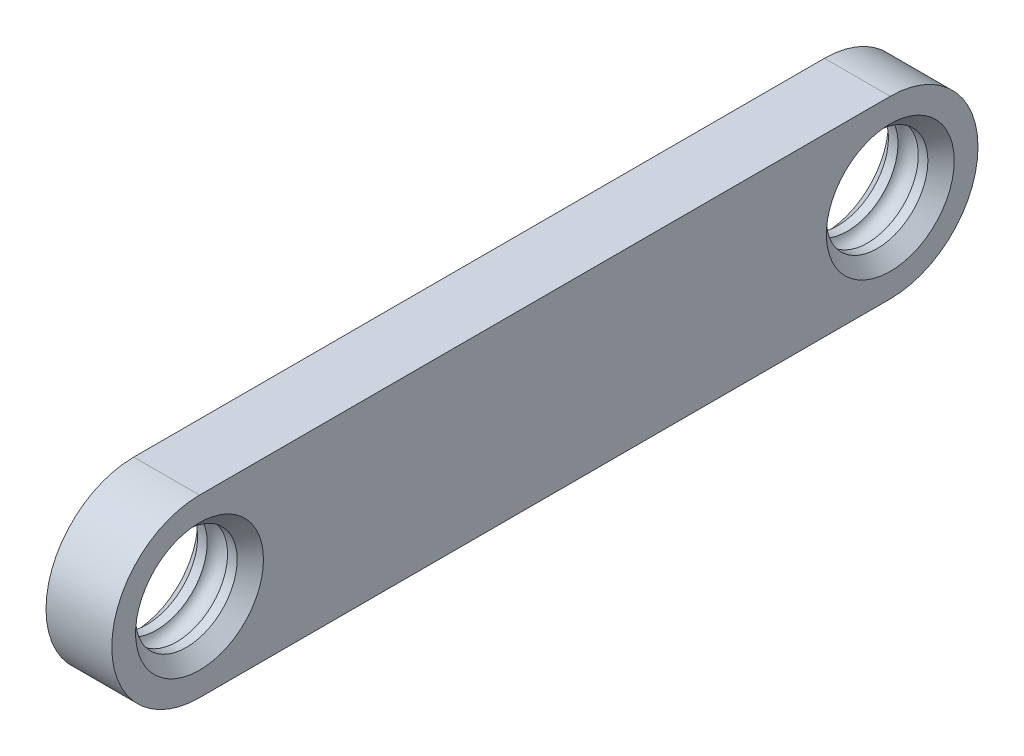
ISO-10303-21;
HEADER;
FILE_DESCRIPTION(('STEP AP214'),'2;1');
FILE_NAME('part.step','',(''),(''),'','','');
FILE_SCHEMA(('AUTOMOTIVE_DESIGN { 1 0 10303 214 1 1 1 1 }'));
ENDSEC;
DATA;
#1=APPLICATION_CONTEXT('core data for automotive mechanical design processes');
#2=APPLICATION_PROTOCOL_DEFINITION('international standard','automotive_design',2000,#1);
#3=PRODUCT_CONTEXT('',#1,'mechanical');
#4=PRODUCT('Part','Part','',(#3));
#5=PRODUCT_RELATED_PRODUCT_CATEGORY('part','',(#4));
#6=PRODUCT_DEFINITION_FORMATION('','',#4);
#7=PRODUCT_DEFINITION_CONTEXT('part definition',#1,'design');
#8=PRODUCT_DEFINITION('design','',#6,#7);
#9=PRODUCT_DEFINITION_SHAPE('','',#8);
#10=(LENGTH_UNIT() NAMED_UNIT(*) SI_UNIT(.MILLI.,.METRE.));
#11=(NAMED_UNIT(*) PLANE_ANGLE_UNIT() SI_UNIT($,.RADIAN.));
#12=(NAMED_UNIT(*) SI_UNIT($,.STERADIAN.) SOLID_ANGLE_UNIT());
#13=UNCERTAINTY_MEASURE_WITH_UNIT(LENGTH_MEASURE(1.E-05),#10,'distance_accuracy_value','');
#14=(GEOMETRIC_REPRESENTATION_CONTEXT(3) GLOBAL_UNCERTAINTY_ASSIGNED_CONTEXT((#13)) GLOBAL_UNIT_ASSIGNED_CONTEXT((#10,
#11,#12)) REPRESENTATION_CONTEXT('',''));
#15=CARTESIAN_POINT('',(0.,0.,0.));
#16=DIRECTION('',(0.,0.,1.));
#17=DIRECTION('',(1.,0.,0.));
#18=AXIS2_PLACEMENT_3D('',#15,#16,#17);
#19=CARTESIAN_POINT('',(4.7625,0.,-50.));
#20=DIRECTION('',(-1.,0.,0.));
#21=DIRECTION('',(0.,0.,1.));
#22=AXIS2_PLACEMENT_3D('',#19,#20,#21);
#23=CYLINDRICAL_SURFACE('',#22,3.675);
#24=CARTESIAN_POINT('',(1.64637649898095,0.,-50.));
#25=DIRECTION('',(1.,0.,0.));
#26=DIRECTION('',(0.,0.,-1.));
#27=AXIS2_PLACEMENT_3D('',#24,#25,#26);
#28=CIRCLE('',#27,3.675);
#29=CARTESIAN_POINT('',(1.64637649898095,0.,-46.325));
#30=VERTEX_POINT('',#29);
#31=EDGE_CURVE('E47',#30,#30,#28,.F.);
#32=CARTESIAN_POINT('',(0.95249999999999,0.,-50.));
#33=DIRECTION('',(1.,0.,0.));
#34=DIRECTION('',(0.,0.,-1.));
#35=AXIS2_PLACEMENT_3D('',#32,#33,#34);
#36=CIRCLE('',#35,3.675);
#37=CARTESIAN_POINT('',(0.952499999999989,0.,-46.325));
#38=VERTEX_POINT('',#37);
#39=EDGE_CURVE('E11',#38,#38,#36,.F.);
#40=CARTESIAN_POINT('',(1.64637649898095,0.,-46.325));
#41=CARTESIAN_POINT('',(1.63914861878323,0.,-46.325));
#42=CARTESIAN_POINT('',(1.63192073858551,0.,-46.325));
#43=CARTESIAN_POINT('',(1.61746497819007,0.,-46.325));
#44=CARTESIAN_POINT('',(1.61023709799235,0.,-46.325));
#45=CARTESIAN_POINT('',(1.59578133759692,0.,-46.325));
#46=CARTESIAN_POINT('',(1.5885534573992,0.,-46.325));
#47=CARTESIAN_POINT('',(1.57409769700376,0.,-46.325));
#48=CARTESIAN_POINT('',(1.56686981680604,0.,-46.325));
#49=CARTESIAN_POINT('',(1.55241405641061,0.,-46.325));
#50=CARTESIAN_POINT('',(1.54518617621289,0.,-46.325));
#51=CARTESIAN_POINT('',(1.53073041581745,0.,-46.325));
#52=CARTESIAN_POINT('',(1.52350253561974,0.,-46.325));
#53=CARTESIAN_POINT('',(1.5090467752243,0.,-46.325));
#54=CARTESIAN_POINT('',(1.50181889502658,0.,-46.325));
#55=CARTESIAN_POINT('',(1.48736313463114,0.,-46.325));
#56=CARTESIAN_POINT('',(1.48013525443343,0.,-46.325));
#57=CARTESIAN_POINT('',(1.46567949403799,0.,-46.325));
#58=CARTESIAN_POINT('',(1.45845161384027,0.,-46.325));
#59=CARTESIAN_POINT('',(1.44399585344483,0.,-46.325));
#60=CARTESIAN_POINT('',(1.43676797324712,0.,-46.325));
#61=CARTESIAN_POINT('',(1.42231221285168,0.,-46.325));
#62=CARTESIAN_POINT('',(1.41508433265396,0.,-46.325));
#63=CARTESIAN_POINT('',(1.40062857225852,0.,-46.325));
#64=CARTESIAN_POINT('',(1.39340069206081,0.,-46.325));
#65=CARTESIAN_POINT('',(1.37894493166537,0.,-46.325));
#66=CARTESIAN_POINT('',(1.37171705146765,0.,-46.325));
#67=CARTESIAN_POINT('',(1.35726129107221,0.,-46.325));
#68=CARTESIAN_POINT('',(1.3500334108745,0.,-46.325));
#69=CARTESIAN_POINT('',(1.33557765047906,0.,-46.325));
#70=CARTESIAN_POINT('',(1.32834977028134,0.,-46.325));
#71=CARTESIAN_POINT('',(1.3138940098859,0.,-46.325));
#72=CARTESIAN_POINT('',(1.30666612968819,0.,-46.325));
#73=CARTESIAN_POINT('',(1.29221036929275,0.,-46.325));
#74=CARTESIAN_POINT('',(1.28498248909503,0.,-46.325));
#75=CARTESIAN_POINT('',(1.27052672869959,0.,-46.325));
#76=CARTESIAN_POINT('',(1.26329884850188,0.,-46.325));
#77=CARTESIAN_POINT('',(1.24884308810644,0.,-46.325));
#78=CARTESIAN_POINT('',(1.24161520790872,0.,-46.325));
#79=CARTESIAN_POINT('',(1.22715944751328,0.,-46.325));
#80=CARTESIAN_POINT('',(1.21993156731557,0.,-46.325));
#81=CARTESIAN_POINT('',(1.20547580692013,0.,-46.325));
#82=CARTESIAN_POINT('',(1.19824792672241,0.,-46.325));
#83=CARTESIAN_POINT('',(1.18379216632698,0.,-46.325));
#84=CARTESIAN_POINT('',(1.17656428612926,0.,-46.325));
#85=CARTESIAN_POINT('',(1.16210852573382,0.,-46.325));
#86=CARTESIAN_POINT('',(1.1548806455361,0.,-46.325));
#87=CARTESIAN_POINT('',(1.14042488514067,0.,-46.325));
#88=CARTESIAN_POINT('',(1.13319700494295,0.,-46.325));
#89=CARTESIAN_POINT('',(1.11874124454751,0.,-46.325));
#90=CARTESIAN_POINT('',(1.11151336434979,0.,-46.325));
#91=CARTESIAN_POINT('',(1.09705760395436,0.,-46.325));
#92=CARTESIAN_POINT('',(1.08982972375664,0.,-46.325));
#93=CARTESIAN_POINT('',(1.0753739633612,0.,-46.325));
#94=CARTESIAN_POINT('',(1.06814608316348,0.,-46.325));
#95=CARTESIAN_POINT('',(1.05369032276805,0.,-46.325));
#96=CARTESIAN_POINT('',(1.04646244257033,0.,-46.325));
#97=CARTESIAN_POINT('',(1.03200668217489,0.,-46.325));
#98=CARTESIAN_POINT('',(1.02477880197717,0.,-46.325));
#99=CARTESIAN_POINT('',(1.01032304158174,0.,-46.325));
#100=CARTESIAN_POINT('',(1.00309516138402,0.,-46.325));
#101=CARTESIAN_POINT('',(0.988639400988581,0.,-46.325));
#102=CARTESIAN_POINT('',(0.981411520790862,0.,-46.325));
#103=CARTESIAN_POINT('',(0.966955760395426,0.,-46.325));
#104=CARTESIAN_POINT('',(0.959727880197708,0.,-46.325));
#105=CARTESIAN_POINT('',(0.952499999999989,0.,-46.325));
#106=B_SPLINE_CURVE_WITH_KNOTS('',3,(#40,#41,#42,#43,#44,#45,#46,#47,#48,#49,#50,#51,#52,#53,
#54,#55,#56,#57,#58,#59,#60,#61,#62,#63,#64,#65,#66,#67,#68,#69,#70,#71,#72,#73,#74,#75,#76,#77,
#78,#79,#80,#81,#82,#83,#84,#85,#86,#87,#88,#89,#90,#91,#92,#93,#94,#95,#96,#97,#98,#99,#100,
#101,#102,#103,#104,#105),.UNSPECIFIED.,.F.,.F.,(4,2,2,2,2,2,2,2,2,2,2,2,2,2,2,2,2,2,2,2,2,2,2,
2,2,2,2,2,2,2,2,2,4),(0.,0.0216836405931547,0.0433672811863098,0.0650509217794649,
0.0867345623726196,0.108418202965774,0.130101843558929,0.151785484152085,0.173469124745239,
0.195152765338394,0.216836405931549,0.238520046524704,0.260203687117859,0.281887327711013,
0.303570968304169,0.325254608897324,0.346938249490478,0.368621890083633,0.390305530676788,
0.411989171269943,0.433672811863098,0.455356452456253,0.477040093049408,0.498723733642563,
0.520407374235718,0.542091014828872,0.563774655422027,0.585458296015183,0.607141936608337,
0.628825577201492,0.650509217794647,0.672192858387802,0.693876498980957),.UNSPECIFIED.);
#107=EDGE_CURVE('BSEAM42',#30,#38,#106,.T.);
#108=ORIENTED_EDGE('',*,*,#31,.F.);
#109=ORIENTED_EDGE('',*,*,#39,.T.);
#110=ORIENTED_EDGE('',*,*,#107,.T.);
#111=ORIENTED_EDGE('',*,*,#107,.F.);
#112=EDGE_LOOP('',(#108,#110,#109,#111));
#113=FACE_BOUND('',#112,.T.);
#114=ADVANCED_FACE('F42',(#113),#23,.F.);
#115=CARTESIAN_POINT('',(4.7625,0.,0.));
#116=DIRECTION('',(-1.,0.,0.));
#117=DIRECTION('',(0.,0.,1.));
#118=AXIS2_PLACEMENT_3D('',#115,#116,#117);
#119=CYLINDRICAL_SURFACE('',#118,3.675);
#120=CARTESIAN_POINT('',(1.64637649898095,0.,0.));
#121=DIRECTION('',(1.,0.,0.));
#122=DIRECTION('',(0.,0.,-1.));
#123=AXIS2_PLACEMENT_3D('',#120,#121,#122);
#124=CIRCLE('',#123,3.675);
#125=CARTESIAN_POINT('',(1.64637649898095,0.,3.675));
#126=VERTEX_POINT('',#125);
#127=EDGE_CURVE('E115',#126,#126,#124,.F.);
#128=CARTESIAN_POINT('',(0.952499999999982,0.,0.));
#129=DIRECTION('',(1.,0.,0.));
#130=DIRECTION('',(0.,0.,-1.));
#131=AXIS2_PLACEMENT_3D('',#128,#129,#130);
#132=CIRCLE('',#131,3.675);
#133=CARTESIAN_POINT('',(0.952499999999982,0.,3.675));
#134=VERTEX_POINT('',#133);
#135=EDGE_CURVE('E132',#134,#134,#132,.F.);
#136=CARTESIAN_POINT('',(1.64637649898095,0.,3.675));
#137=CARTESIAN_POINT('',(1.63914861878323,0.,3.675));
#138=CARTESIAN_POINT('',(1.63192073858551,0.,3.675));
#139=CARTESIAN_POINT('',(1.61746497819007,0.,3.675));
#140=CARTESIAN_POINT('',(1.61023709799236,0.,3.675));
#141=CARTESIAN_POINT('',(1.59578133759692,0.,3.675));
#142=CARTESIAN_POINT('',(1.5885534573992,0.,3.675));
#143=CARTESIAN_POINT('',(1.57409769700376,0.,3.675));
#144=CARTESIAN_POINT('',(1.56686981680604,0.,3.675));
#145=CARTESIAN_POINT('',(1.55241405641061,0.,3.675));
#146=CARTESIAN_POINT('',(1.54518617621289,0.,3.675));
#147=CARTESIAN_POINT('',(1.53073041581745,0.,3.675));
#148=CARTESIAN_POINT('',(1.52350253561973,0.,3.675));
#149=CARTESIAN_POINT('',(1.5090467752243,0.,3.675));
#150=CARTESIAN_POINT('',(1.50181889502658,0.,3.675));
#151=CARTESIAN_POINT('',(1.48736313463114,0.,3.675));
#152=CARTESIAN_POINT('',(1.48013525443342,0.,3.675));
#153=CARTESIAN_POINT('',(1.46567949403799,0.,3.675));
#154=CARTESIAN_POINT('',(1.45845161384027,0.,3.675));
#155=CARTESIAN_POINT('',(1.44399585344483,0.,3.675));
#156=CARTESIAN_POINT('',(1.43676797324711,0.,3.675));
#157=CARTESIAN_POINT('',(1.42231221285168,0.,3.675));
#158=CARTESIAN_POINT('',(1.41508433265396,0.,3.675));
#159=CARTESIAN_POINT('',(1.40062857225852,0.,3.675));
#160=CARTESIAN_POINT('',(1.3934006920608,0.,3.675));
#161=CARTESIAN_POINT('',(1.37894493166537,0.,3.675));
#162=CARTESIAN_POINT('',(1.37171705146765,0.,3.675));
#163=CARTESIAN_POINT('',(1.35726129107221,0.,3.675));
#164=CARTESIAN_POINT('',(1.35003341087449,0.,3.675));
#165=CARTESIAN_POINT('',(1.33557765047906,0.,3.675));
#166=CARTESIAN_POINT('',(1.32834977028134,0.,3.675));
#167=CARTESIAN_POINT('',(1.3138940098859,0.,3.675));
#168=CARTESIAN_POINT('',(1.30666612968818,0.,3.675));
#169=CARTESIAN_POINT('',(1.29221036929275,0.,3.675));
#170=CARTESIAN_POINT('',(1.28498248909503,0.,3.675));
#171=CARTESIAN_POINT('',(1.27052672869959,0.,3.675));
#172=CARTESIAN_POINT('',(1.26329884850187,0.,3.675));
#173=CARTESIAN_POINT('',(1.24884308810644,0.,3.675));
#174=CARTESIAN_POINT('',(1.24161520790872,0.,3.675));
#175=CARTESIAN_POINT('',(1.22715944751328,0.,3.675));
#176=CARTESIAN_POINT('',(1.21993156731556,0.,3.675));
#177=CARTESIAN_POINT('',(1.20547580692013,0.,3.675));
#178=CARTESIAN_POINT('',(1.19824792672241,0.,3.675));
#179=CARTESIAN_POINT('',(1.18379216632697,0.,3.675));
#180=CARTESIAN_POINT('',(1.17656428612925,0.,3.675));
#181=CARTESIAN_POINT('',(1.16210852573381,0.,3.675));
#182=CARTESIAN_POINT('',(1.1548806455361,0.,3.675));
#183=CARTESIAN_POINT('',(1.14042488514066,0.,3.675));
#184=CARTESIAN_POINT('',(1.13319700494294,0.,3.675));
#185=CARTESIAN_POINT('',(1.1187412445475,0.,3.675));
#186=CARTESIAN_POINT('',(1.11151336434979,0.,3.675));
#187=CARTESIAN_POINT('',(1.09705760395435,0.,3.675));
#188=CARTESIAN_POINT('',(1.08982972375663,0.,3.675));
#189=CARTESIAN_POINT('',(1.07537396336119,0.,3.675));
#190=CARTESIAN_POINT('',(1.06814608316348,0.,3.675));
#191=CARTESIAN_POINT('',(1.05369032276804,0.,3.675));
#192=CARTESIAN_POINT('',(1.04646244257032,0.,3.675));
#193=CARTESIAN_POINT('',(1.03200668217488,0.,3.675));
#194=CARTESIAN_POINT('',(1.02477880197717,0.,3.675));
#195=CARTESIAN_POINT('',(1.01032304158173,0.,3.675));
#196=CARTESIAN_POINT('',(1.00309516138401,0.,3.675));
#197=CARTESIAN_POINT('',(0.988639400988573,0.,3.675));
#198=CARTESIAN_POINT('',(0.981411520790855,0.,3.675));
#199=CARTESIAN_POINT('',(0.966955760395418,0.,3.675));
#200=CARTESIAN_POINT('',(0.9597278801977,0.,3.675));
#201=CARTESIAN_POINT('',(0.952499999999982,0.,3.675));
#202=B_SPLINE_CURVE_WITH_KNOTS('',3,(#136,#137,#138,#139,#140,#141,#142,#143,#144,#145,#146,
#147,#148,#149,#150,#151,#152,#153,#154,#155,#156,#157,#158,#159,#160,#161,#162,#163,#164,#165,
#166,#167,#168,#169,#170,#171,#172,#173,#174,#175,#176,#177,#178,#179,#180,#181,#182,#183,#184,
#185,#186,#187,#188,#189,#190,#191,#192,#193,#194,#195,#196,#197,#198,#199,#200,#201),
.UNSPECIFIED.,.F.,.F.,(4,2,2,2,2,2,2,2,2,2,2,2,2,2,2,2,2,2,2,2,2,2,2,2,2,2,2,2,2,2,2,2,4),(0.,
0.0216836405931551,0.0433672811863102,0.0650509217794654,0.0867345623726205,0.108418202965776,
0.130101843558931,0.151785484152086,0.173469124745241,0.195152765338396,0.216836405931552,
0.238520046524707,0.260203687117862,0.281887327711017,0.303570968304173,0.325254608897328,
0.346938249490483,0.368621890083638,0.390305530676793,0.411989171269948,0.433672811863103,
0.455356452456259,0.477040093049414,0.498723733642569,0.520407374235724,0.542091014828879,
0.563774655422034,0.585458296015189,0.607141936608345,0.6288255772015,0.650509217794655,
0.67219285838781,0.693876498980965),.UNSPECIFIED.);
#203=EDGE_CURVE('BSEAM158',#126,#134,#202,.T.);
#204=ORIENTED_EDGE('',*,*,#127,.F.);
#205=ORIENTED_EDGE('',*,*,#135,.T.);
#206=ORIENTED_EDGE('',*,*,#203,.T.);
#207=ORIENTED_EDGE('',*,*,#203,.F.);
#208=EDGE_LOOP('',(#204,#206,#205,#207));
#209=FACE_BOUND('',#208,.T.);
#210=ADVANCED_FACE('F158',(#209),#119,.F.);
#211=CARTESIAN_POINT('',(4.7625,-6.35,0.));
#212=DIRECTION('',(0.,1.,0.));
#213=DIRECTION('',(0.,0.,1.));
#214=AXIS2_PLACEMENT_3D('',#211,#212,#213);
#215=PLANE('',#214);
#216=DIRECTION('',(0.,0.,-1.));
#217=VECTOR('',#216,1.);
#218=CARTESIAN_POINT('',(0.,-6.35,0.));
#219=LINE('',#218,#217);
#220=CARTESIAN_POINT('',(0.,-6.35,0.));
#221=VERTEX_POINT('',#220);
#222=CARTESIAN_POINT('',(0.,-6.35,-50.));
#223=VERTEX_POINT('',#222);
#224=EDGE_CURVE('E112',#221,#223,#219,.T.);
#225=ORIENTED_EDGE('',*,*,#224,.T.);
#226=DIRECTION('',(-1.,0.,0.));
#227=VECTOR('',#226,1.);
#228=CARTESIAN_POINT('',(4.7625,-6.35,-50.));
#229=LINE('',#228,#227);
#230=CARTESIAN_POINT('',(4.7625,-6.35,-50.));
#231=VERTEX_POINT('',#230);
#232=EDGE_CURVE('E104',#231,#223,#229,.T.);
#233=ORIENTED_EDGE('',*,*,#232,.F.);
#234=DIRECTION('',(0.,0.,-1.));
#235=VECTOR('',#234,1.);
#236=CARTESIAN_POINT('',(4.7625,-6.35,0.));
#237=LINE('',#236,#235);
#238=CARTESIAN_POINT('',(4.7625,-6.35,0.));
#239=VERTEX_POINT('',#238);
#240=EDGE_CURVE('E94',#239,#231,#237,.T.);
#241=ORIENTED_EDGE('',*,*,#240,.F.);
#242=DIRECTION('',(-1.,0.,0.));
#243=VECTOR('',#242,1.);
#244=CARTESIAN_POINT('',(4.7625,-6.35,0.));
#245=LINE('',#244,#243);
#246=EDGE_CURVE('E108',#239,#221,#245,.T.);
#247=ORIENTED_EDGE('',*,*,#246,.T.);
#248=EDGE_LOOP('',(#225,#233,#241,#247));
#249=FACE_BOUND('',#248,.T.);
#250=ADVANCED_FACE('F177',(#249),#215,.F.);
#251=CARTESIAN_POINT('',(4.7625,0.,-50.));
#252=DIRECTION('',(-1.,0.,0.));
#253=DIRECTION('',(0.,0.,1.));
#254=AXIS2_PLACEMENT_3D('',#251,#252,#253);
#255=CYLINDRICAL_SURFACE('',#254,6.35);
#256=CARTESIAN_POINT('',(0.,0.,-50.));
#257=DIRECTION('',(1.,0.,0.));
#258=DIRECTION('',(0.,0.,-1.));
#259=AXIS2_PLACEMENT_3D('',#256,#257,#258);
#260=CIRCLE('',#259,6.35);
#261=CARTESIAN_POINT('',(0.,6.35,-50.));
#262=VERTEX_POINT('',#261);
#263=EDGE_CURVE('E100',#223,#262,#260,.T.);
#264=ORIENTED_EDGE('',*,*,#263,.T.);
#265=DIRECTION('',(-1.,0.,0.));
#266=VECTOR('',#265,1.);
#267=CARTESIAN_POINT('',(4.7625,6.35,-50.));
#268=LINE('',#267,#266);
#269=CARTESIAN_POINT('',(4.7625,6.35,-50.));
#270=VERTEX_POINT('',#269);
#271=EDGE_CURVE('E98',#270,#262,#268,.T.);
#272=ORIENTED_EDGE('',*,*,#271,.F.);
#273=CARTESIAN_POINT('',(4.7625,0.,-50.));
#274=DIRECTION('',(1.,0.,0.));
#275=DIRECTION('',(0.,0.,-1.));
#276=AXIS2_PLACEMENT_3D('',#273,#274,#275);
#277=CIRCLE('',#276,6.35);
#278=EDGE_CURVE('E89',#231,#270,#277,.T.);
#279=ORIENTED_EDGE('',*,*,#278,.F.);
#280=ORIENTED_EDGE('',*,*,#232,.T.);
#281=EDGE_LOOP('',(#264,#272,#279,#280));
#282=FACE_BOUND('',#281,.T.);
#283=ADVANCED_FACE('F99',(#282),#255,.T.);
#284=CARTESIAN_POINT('',(4.7625,6.35,0.));
#285=DIRECTION('',(0.,1.,0.));
#286=DIRECTION('',(0.,0.,1.));
#287=AXIS2_PLACEMENT_3D('',#284,#285,#286);
#288=PLANE('',#287);
#289=DIRECTION('',(0.,0.,-1.));
#290=VECTOR('',#289,1.);
#291=CARTESIAN_POINT('',(0.,6.35,0.));
#292=LINE('',#291,#290);
#293=CARTESIAN_POINT('',(0.,6.35,0.));
#294=VERTEX_POINT('',#293);
#295=EDGE_CURVE('E117',#294,#262,#292,.T.);
#296=ORIENTED_EDGE('',*,*,#295,.F.);
#297=DIRECTION('',(-1.,0.,0.));
#298=VECTOR('',#297,1.);
#299=CARTESIAN_POINT('',(4.7625,6.35,0.));
#300=LINE('',#299,#298);
#301=CARTESIAN_POINT('',(4.7625,6.35,0.));
#302=VERTEX_POINT('',#301);
#303=EDGE_CURVE('E78',#302,#294,#300,.T.);
#304=ORIENTED_EDGE('',*,*,#303,.F.);
#305=DIRECTION('',(0.,0.,-1.));
#306=VECTOR('',#305,1.);
#307=CARTESIAN_POINT('',(4.7625,6.35,0.));
#308=LINE('',#307,#306);
#309=EDGE_CURVE('E92',#302,#270,#308,.T.);
#310=ORIENTED_EDGE('',*,*,#309,.T.);
#311=ORIENTED_EDGE('',*,*,#271,.T.);
#312=EDGE_LOOP('',(#296,#304,#310,#311));
#313=FACE_BOUND('',#312,.T.);
#314=ADVANCED_FACE('F106',(#313),#288,.T.);
#315=CARTESIAN_POINT('',(3.11612350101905,0.,0.));
#316=DIRECTION('',(-1.,0.,0.));
#317=DIRECTION('',(0.,0.,1.));
#318=AXIS2_PLACEMENT_3D('',#315,#316,#317);
#319=CIRCLE('',#318,3.675);
#320=CARTESIAN_POINT('',(3.11612350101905,0.,3.675));
#321=VERTEX_POINT('',#320);
#322=EDGE_CURVE('E143',#321,#321,#319,.F.);
#323=CARTESIAN_POINT('',(3.80999999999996,0.,0.));
#324=DIRECTION('',(1.,0.,0.));
#325=DIRECTION('',(0.,0.,-1.));
#326=AXIS2_PLACEMENT_3D('',#323,#324,#325);
#327=CIRCLE('',#326,3.675);
#328=CARTESIAN_POINT('',(3.80999999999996,0.,3.675));
#329=VERTEX_POINT('',#328);
#330=EDGE_CURVE('E129',#329,#329,#327,.T.);
#331=CARTESIAN_POINT('',(3.11612350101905,0.,3.675));
#332=CARTESIAN_POINT('',(3.12335138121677,0.,3.675));
#333=CARTESIAN_POINT('',(3.13057926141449,0.,3.675));
#334=CARTESIAN_POINT('',(3.14503502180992,0.,3.675));
#335=CARTESIAN_POINT('',(3.15226290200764,0.,3.675));
#336=CARTESIAN_POINT('',(3.16671866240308,0.,3.675));
#337=CARTESIAN_POINT('',(3.1739465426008,0.,3.675));
#338=CARTESIAN_POINT('',(3.18840230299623,0.,3.675));
#339=CARTESIAN_POINT('',(3.19563018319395,0.,3.675));
#340=CARTESIAN_POINT('',(3.21008594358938,0.,3.675));
#341=CARTESIAN_POINT('',(3.2173138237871,0.,3.675));
#342=CARTESIAN_POINT('',(3.23176958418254,0.,3.675));
#343=CARTESIAN_POINT('',(3.23899746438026,0.,3.675));
#344=CARTESIAN_POINT('',(3.25345322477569,0.,3.675));
#345=CARTESIAN_POINT('',(3.26068110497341,0.,3.675));
#346=CARTESIAN_POINT('',(3.27513686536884,0.,3.675));
#347=CARTESIAN_POINT('',(3.28236474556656,0.,3.675));
#348=CARTESIAN_POINT('',(3.296820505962,0.,3.675));
#349=CARTESIAN_POINT('',(3.30404838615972,0.,3.675));
#350=CARTESIAN_POINT('',(3.31850414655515,0.,3.675));
#351=CARTESIAN_POINT('',(3.32573202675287,0.,3.675));
#352=CARTESIAN_POINT('',(3.3401877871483,0.,3.675));
#353=CARTESIAN_POINT('',(3.34741566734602,0.,3.675));
#354=CARTESIAN_POINT('',(3.36187142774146,0.,3.675));
#355=CARTESIAN_POINT('',(3.36909930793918,0.,3.675));
#356=CARTESIAN_POINT('',(3.38355506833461,0.,3.675));
#357=CARTESIAN_POINT('',(3.39078294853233,0.,3.675));
#358=CARTESIAN_POINT('',(3.40523870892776,0.,3.675));
#359=CARTESIAN_POINT('',(3.41246658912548,0.,3.675));
#360=CARTESIAN_POINT('',(3.42692234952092,0.,3.675));
#361=CARTESIAN_POINT('',(3.43415022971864,0.,3.675));
#362=CARTESIAN_POINT('',(3.44860599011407,0.,3.675));
#363=CARTESIAN_POINT('',(3.45583387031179,0.,3.675));
#364=CARTESIAN_POINT('',(3.47028963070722,0.,3.675));
#365=CARTESIAN_POINT('',(3.47751751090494,0.,3.675));
#366=CARTESIAN_POINT('',(3.49197327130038,0.,3.675));
#367=CARTESIAN_POINT('',(3.4992011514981,0.,3.675));
#368=CARTESIAN_POINT('',(3.51365691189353,0.,3.675));
#369=CARTESIAN_POINT('',(3.52088479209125,0.,3.675));
#370=CARTESIAN_POINT('',(3.53534055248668,0.,3.675));
#371=CARTESIAN_POINT('',(3.5425684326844,0.,3.675));
#372=CARTESIAN_POINT('',(3.55702419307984,0.,3.675));
#373=CARTESIAN_POINT('',(3.56425207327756,0.,3.675));
#374=CARTESIAN_POINT('',(3.57870783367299,0.,3.675));
#375=CARTESIAN_POINT('',(3.58593571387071,0.,3.675));
#376=CARTESIAN_POINT('',(3.60039147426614,0.,3.675));
#377=CARTESIAN_POINT('',(3.60761935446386,0.,3.675));
#378=CARTESIAN_POINT('',(3.6220751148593,0.,3.675));
#379=CARTESIAN_POINT('',(3.62930299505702,0.,3.675));
#380=CARTESIAN_POINT('',(3.64375875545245,0.,3.675));
#381=CARTESIAN_POINT('',(3.65098663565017,0.,3.675));
#382=CARTESIAN_POINT('',(3.6654423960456,0.,3.675));
#383=CARTESIAN_POINT('',(3.67267027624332,0.,3.675));
#384=CARTESIAN_POINT('',(3.68712603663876,0.,3.675));
#385=CARTESIAN_POINT('',(3.69435391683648,0.,3.675));
#386=CARTESIAN_POINT('',(3.70880967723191,0.,3.675));
#387=CARTESIAN_POINT('',(3.71603755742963,0.,3.675));
#388=CARTESIAN_POINT('',(3.73049331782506,0.,3.675));
#389=CARTESIAN_POINT('',(3.73772119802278,0.,3.675));
#390=CARTESIAN_POINT('',(3.75217695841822,0.,3.675));
#391=CARTESIAN_POINT('',(3.75940483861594,0.,3.675));
#392=CARTESIAN_POINT('',(3.77386059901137,0.,3.675));
#393=CARTESIAN_POINT('',(3.78108847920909,0.,3.675));
#394=CARTESIAN_POINT('',(3.79554423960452,0.,3.675));
#395=CARTESIAN_POINT('',(3.80277211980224,0.,3.675));
#396=CARTESIAN_POINT('',(3.80999999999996,0.,3.675));
#397=B_SPLINE_CURVE_WITH_KNOTS('',3,(#331,#332,#333,#334,#335,#336,#337,#338,#339,#340,#341,
#342,#343,#344,#345,#346,#347,#348,#349,#350,#351,#352,#353,#354,#355,#356,#357,#358,#359,#360,
#361,#362,#363,#364,#365,#366,#367,#368,#369,#370,#371,#372,#373,#374,#375,#376,#377,#378,#379,
#380,#381,#382,#383,#384,#385,#386,#387,#388,#389,#390,#391,#392,#393,#394,#395,#396),
.UNSPECIFIED.,.F.,.F.,(4,2,2,2,2,2,2,2,2,2,2,2,2,2,2,2,2,2,2,2,2,2,2,2,2,2,2,2,2,2,2,2,4),(0.,
0.0216836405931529,0.0433672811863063,0.0650509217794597,0.0867345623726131,0.108418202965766,
0.130101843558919,0.151785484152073,0.173469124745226,0.19515276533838,0.216836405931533,
0.238520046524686,0.26020368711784,0.281887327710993,0.303570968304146,0.325254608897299,
0.346938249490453,0.368621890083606,0.39030553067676,0.411989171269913,0.433672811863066,
0.45535645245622,0.477040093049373,0.498723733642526,0.520407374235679,0.542091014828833,
0.563774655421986,0.585458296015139,0.607141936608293,0.628825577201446,0.6505092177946,
0.672192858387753,0.693876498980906),.UNSPECIFIED.);
#398=EDGE_CURVE('BSEAM188',#321,#329,#397,.T.);
#399=ORIENTED_EDGE('',*,*,#322,.F.);
#400=ORIENTED_EDGE('',*,*,#330,.T.);
#401=ORIENTED_EDGE('',*,*,#398,.T.);
#402=ORIENTED_EDGE('',*,*,#398,.F.);
#403=EDGE_LOOP('',(#399,#401,#400,#402));
#404=FACE_BOUND('',#403,.T.);
#405=ADVANCED_FACE('F188',(#404),#119,.F.);
#406=CARTESIAN_POINT('',(3.11612350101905,0.,-50.));
#407=DIRECTION('',(-1.,0.,0.));
#408=DIRECTION('',(0.,0.,1.));
#409=AXIS2_PLACEMENT_3D('',#406,#407,#408);
#410=CIRCLE('',#409,3.675);
#411=CARTESIAN_POINT('',(3.11612350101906,0.,-46.325));
#412=VERTEX_POINT('',#411);
#413=EDGE_CURVE('E147',#412,#412,#410,.F.);
#414=CARTESIAN_POINT('',(3.80999999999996,0.,-50.));
#415=DIRECTION('',(1.,0.,0.));
#416=DIRECTION('',(0.,0.,-1.));
#417=AXIS2_PLACEMENT_3D('',#414,#415,#416);
#418=CIRCLE('',#417,3.675);
#419=CARTESIAN_POINT('',(3.80999999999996,0.,-46.325));
#420=VERTEX_POINT('',#419);
#421=EDGE_CURVE('E53',#420,#420,#418,.T.);
#422=CARTESIAN_POINT('',(3.11612350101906,0.,-46.325));
#423=CARTESIAN_POINT('',(3.12335138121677,0.,-46.325));
#424=CARTESIAN_POINT('',(3.13057926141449,0.,-46.325));
#425=CARTESIAN_POINT('',(3.14503502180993,0.,-46.325));
#426=CARTESIAN_POINT('',(3.15226290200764,0.,-46.325));
#427=CARTESIAN_POINT('',(3.16671866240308,0.,-46.325));
#428=CARTESIAN_POINT('',(3.1739465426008,0.,-46.325));
#429=CARTESIAN_POINT('',(3.18840230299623,0.,-46.325));
#430=CARTESIAN_POINT('',(3.19563018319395,0.,-46.325));
#431=CARTESIAN_POINT('',(3.21008594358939,0.,-46.325));
#432=CARTESIAN_POINT('',(3.2173138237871,0.,-46.325));
#433=CARTESIAN_POINT('',(3.23176958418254,0.,-46.325));
#434=CARTESIAN_POINT('',(3.23899746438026,0.,-46.325));
#435=CARTESIAN_POINT('',(3.25345322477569,0.,-46.325));
#436=CARTESIAN_POINT('',(3.26068110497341,0.,-46.325));
#437=CARTESIAN_POINT('',(3.27513686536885,0.,-46.325));
#438=CARTESIAN_POINT('',(3.28236474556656,0.,-46.325));
#439=CARTESIAN_POINT('',(3.296820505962,0.,-46.325));
#440=CARTESIAN_POINT('',(3.30404838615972,0.,-46.325));
#441=CARTESIAN_POINT('',(3.31850414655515,0.,-46.325));
#442=CARTESIAN_POINT('',(3.32573202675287,0.,-46.325));
#443=CARTESIAN_POINT('',(3.3401877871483,0.,-46.325));
#444=CARTESIAN_POINT('',(3.34741566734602,0.,-46.325));
#445=CARTESIAN_POINT('',(3.36187142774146,0.,-46.325));
#446=CARTESIAN_POINT('',(3.36909930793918,0.,-46.325));
#447=CARTESIAN_POINT('',(3.38355506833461,0.,-46.325));
#448=CARTESIAN_POINT('',(3.39078294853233,0.,-46.325));
#449=CARTESIAN_POINT('',(3.40523870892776,0.,-46.325));
#450=CARTESIAN_POINT('',(3.41246658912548,0.,-46.325));
#451=CARTESIAN_POINT('',(3.42692234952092,0.,-46.325));
#452=CARTESIAN_POINT('',(3.43415022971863,0.,-46.325));
#453=CARTESIAN_POINT('',(3.44860599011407,0.,-46.325));
#454=CARTESIAN_POINT('',(3.45583387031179,0.,-46.325));
#455=CARTESIAN_POINT('',(3.47028963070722,0.,-46.325));
#456=CARTESIAN_POINT('',(3.47751751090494,0.,-46.325));
#457=CARTESIAN_POINT('',(3.49197327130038,0.,-46.325));
#458=CARTESIAN_POINT('',(3.49920115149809,0.,-46.325));
#459=CARTESIAN_POINT('',(3.51365691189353,0.,-46.325));
#460=CARTESIAN_POINT('',(3.52088479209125,0.,-46.325));
#461=CARTESIAN_POINT('',(3.53534055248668,0.,-46.325));
#462=CARTESIAN_POINT('',(3.5425684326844,0.,-46.325));
#463=CARTESIAN_POINT('',(3.55702419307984,0.,-46.325));
#464=CARTESIAN_POINT('',(3.56425207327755,0.,-46.325));
#465=CARTESIAN_POINT('',(3.57870783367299,0.,-46.325));
#466=CARTESIAN_POINT('',(3.58593571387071,0.,-46.325));
#467=CARTESIAN_POINT('',(3.60039147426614,0.,-46.325));
#468=CARTESIAN_POINT('',(3.60761935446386,0.,-46.325));
#469=CARTESIAN_POINT('',(3.6220751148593,0.,-46.325));
#470=CARTESIAN_POINT('',(3.62930299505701,0.,-46.325));
#471=CARTESIAN_POINT('',(3.64375875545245,0.,-46.325));
#472=CARTESIAN_POINT('',(3.65098663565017,0.,-46.325));
#473=CARTESIAN_POINT('',(3.6654423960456,0.,-46.325));
#474=CARTESIAN_POINT('',(3.67267027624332,0.,-46.325));
#475=CARTESIAN_POINT('',(3.68712603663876,0.,-46.325));
#476=CARTESIAN_POINT('',(3.69435391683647,0.,-46.325));
#477=CARTESIAN_POINT('',(3.70880967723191,0.,-46.325));
#478=CARTESIAN_POINT('',(3.71603755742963,0.,-46.325));
#479=CARTESIAN_POINT('',(3.73049331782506,0.,-46.325));
#480=CARTESIAN_POINT('',(3.73772119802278,0.,-46.325));
#481=CARTESIAN_POINT('',(3.75217695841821,0.,-46.325));
#482=CARTESIAN_POINT('',(3.75940483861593,0.,-46.325));
#483=CARTESIAN_POINT('',(3.77386059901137,0.,-46.325));
#484=CARTESIAN_POINT('',(3.78108847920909,0.,-46.325));
#485=CARTESIAN_POINT('',(3.79554423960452,0.,-46.325));
#486=CARTESIAN_POINT('',(3.80277211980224,0.,-46.325));
#487=CARTESIAN_POINT('',(3.80999999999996,0.,-46.325));
#488=B_SPLINE_CURVE_WITH_KNOTS('',3,(#422,#423,#424,#425,#426,#427,#428,#429,#430,#431,#432,
#433,#434,#435,#436,#437,#438,#439,#440,#441,#442,#443,#444,#445,#446,#447,#448,#449,#450,#451,
#452,#453,#454,#455,#456,#457,#458,#459,#460,#461,#462,#463,#464,#465,#466,#467,#468,#469,#470,
#471,#472,#473,#474,#475,#476,#477,#478,#479,#480,#481,#482,#483,#484,#485,#486,#487),
.UNSPECIFIED.,.F.,.F.,(4,2,2,2,2,2,2,2,2,2,2,2,2,2,2,2,2,2,2,2,2,2,2,2,2,2,2,2,2,2,2,2,4),(0.,
0.0216836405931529,0.0433672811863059,0.0650509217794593,0.0867345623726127,0.108418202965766,
0.130101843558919,0.151785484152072,0.173469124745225,0.195152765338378,0.216836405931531,
0.238520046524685,0.260203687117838,0.281887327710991,0.303570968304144,0.325254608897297,
0.346938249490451,0.368621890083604,0.390305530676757,0.41198917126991,0.433672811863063,
0.455356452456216,0.477040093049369,0.498723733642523,0.520407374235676,0.542091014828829,
0.563774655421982,0.585458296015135,0.607141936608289,0.628825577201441,0.650509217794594,
0.672192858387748,0.693876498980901),.UNSPECIFIED.);
#489=EDGE_CURVE('BSEAM160',#412,#420,#488,.T.);
#490=ORIENTED_EDGE('',*,*,#413,.F.);
#491=ORIENTED_EDGE('',*,*,#421,.T.);
#492=ORIENTED_EDGE('',*,*,#489,.T.);
#493=ORIENTED_EDGE('',*,*,#489,.F.);
#494=EDGE_LOOP('',(#490,#492,#491,#493));
#495=FACE_BOUND('',#494,.T.);
#496=ADVANCED_FACE('F160',(#495),#23,.F.);
#497=CARTESIAN_POINT('',(4.7625,0.,0.));
#498=DIRECTION('',(-1.,0.,0.));
#499=DIRECTION('',(0.,0.,1.));
#500=AXIS2_PLACEMENT_3D('',#497,#498,#499);
#501=CYLINDRICAL_SURFACE('',#500,6.35);
#502=CARTESIAN_POINT('',(0.,0.,0.));
#503=DIRECTION('',(1.,0.,0.));
#504=DIRECTION('',(0.,0.,-1.));
#505=AXIS2_PLACEMENT_3D('',#502,#503,#504);
#506=CIRCLE('',#505,6.35);
#507=EDGE_CURVE('E81',#294,#221,#506,.T.);
#508=ORIENTED_EDGE('',*,*,#507,.T.);
#509=ORIENTED_EDGE('',*,*,#246,.F.);
#510=CARTESIAN_POINT('',(4.7625,0.,0.));
#511=DIRECTION('',(1.,0.,0.));
#512=DIRECTION('',(0.,0.,-1.));
#513=AXIS2_PLACEMENT_3D('',#510,#511,#512);
#514=CIRCLE('',#513,6.35);
#515=EDGE_CURVE('E62',#302,#239,#514,.T.);
#516=ORIENTED_EDGE('',*,*,#515,.F.);
#517=ORIENTED_EDGE('',*,*,#303,.T.);
#518=EDGE_LOOP('',(#508,#509,#516,#517));
#519=FACE_BOUND('',#518,.T.);
#520=ADVANCED_FACE('F178',(#519),#501,.T.);
#521=CARTESIAN_POINT('',(4.7625,0.,0.));
#522=DIRECTION('',(1.,0.,0.));
#523=DIRECTION('',(0.,0.,-1.));
#524=AXIS2_PLACEMENT_3D('',#521,#522,#523);
#525=PLANE('',#524);
#526=CARTESIAN_POINT('',(4.7625,0.,0.));
#527=DIRECTION('',(1.,0.,0.));
#528=DIRECTION('',(0.,0.,-1.));
#529=AXIS2_PLACEMENT_3D('',#526,#527,#528);
#530=CIRCLE('',#529,4.62750000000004);
#531=CARTESIAN_POINT('',(4.7625,0.,-4.62750000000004));
#532=VERTEX_POINT('',#531);
#533=EDGE_CURVE('E138',#532,#532,#530,.F.);
#534=ORIENTED_EDGE('',*,*,#533,.T.);
#535=EDGE_LOOP('',(#534));
#536=FACE_BOUND('',#535,.T.);
#537=CARTESIAN_POINT('',(4.7625,0.,-50.));
#538=DIRECTION('',(1.,0.,0.));
#539=DIRECTION('',(0.,0.,-1.));
#540=AXIS2_PLACEMENT_3D('',#537,#538,#539);
#541=CIRCLE('',#540,4.62750000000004);
#542=CARTESIAN_POINT('',(4.7625,0.,-54.6275));
#543=VERTEX_POINT('',#542);
#544=EDGE_CURVE('E135',#543,#543,#541,.F.);
#545=ORIENTED_EDGE('',*,*,#544,.T.);
#546=EDGE_LOOP('',(#545));
#547=FACE_BOUND('',#546,.T.);
#548=ORIENTED_EDGE('',*,*,#240,.T.);
#549=ORIENTED_EDGE('',*,*,#278,.T.);
#550=ORIENTED_EDGE('',*,*,#309,.F.);
#551=ORIENTED_EDGE('',*,*,#515,.T.);
#552=EDGE_LOOP('',(#548,#549,#550,#551));
#553=FACE_BOUND('',#552,.T.);
#554=ADVANCED_FACE('F90',(#536,#547,#553),#525,.T.);
#555=CARTESIAN_POINT('',(0.,0.,0.));
#556=DIRECTION('',(1.,0.,0.));
#557=DIRECTION('',(0.,0.,-1.));
#558=AXIS2_PLACEMENT_3D('',#555,#556,#557);
#559=PLANE('',#558);
#560=CARTESIAN_POINT('',(0.,0.,0.));
#561=DIRECTION('',(1.,0.,0.));
#562=DIRECTION('',(0.,0.,-1.));
#563=AXIS2_PLACEMENT_3D('',#560,#561,#562);
#564=CIRCLE('',#563,4.62749999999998);
#565=CARTESIAN_POINT('',(0.,0.,-4.62749999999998));
#566=VERTEX_POINT('',#565);
#567=EDGE_CURVE('E126',#566,#566,#564,.T.);
#568=ORIENTED_EDGE('',*,*,#567,.T.);
#569=EDGE_LOOP('',(#568));
#570=FACE_BOUND('',#569,.T.);
#571=CARTESIAN_POINT('',(0.,0.,-50.));
#572=DIRECTION('',(1.,0.,0.));
#573=DIRECTION('',(0.,0.,-1.));
#574=AXIS2_PLACEMENT_3D('',#571,#572,#573);
#575=CIRCLE('',#574,4.62749999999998);
#576=CARTESIAN_POINT('',(0.,0.,-54.6275));
#577=VERTEX_POINT('',#576);
#578=EDGE_CURVE('E123',#577,#577,#575,.T.);
#579=ORIENTED_EDGE('',*,*,#578,.T.);
#580=EDGE_LOOP('',(#579));
#581=FACE_BOUND('',#580,.T.);
#582=ORIENTED_EDGE('',*,*,#224,.F.);
#583=ORIENTED_EDGE('',*,*,#507,.F.);
#584=ORIENTED_EDGE('',*,*,#295,.T.);
#585=ORIENTED_EDGE('',*,*,#263,.F.);
#586=EDGE_LOOP('',(#582,#583,#584,#585));
#587=FACE_BOUND('',#586,.T.);
#588=ADVANCED_FACE('F169',(#570,#581,#587),#559,.F.);
#589=CARTESIAN_POINT('',(0.,0.,0.));
#590=DIRECTION('',(-1.,0.,0.));
#591=DIRECTION('',(0.,0.,1.));
#592=AXIS2_PLACEMENT_3D('',#589,#590,#591);
#593=CONICAL_SURFACE('',#592,4.62749999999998,0.785398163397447);
#594=ORIENTED_EDGE('',*,*,#135,.F.);
#595=EDGE_LOOP('',(#594));
#596=FACE_BOUND('',#595,.T.);
#597=ORIENTED_EDGE('',*,*,#567,.F.);
#598=EDGE_LOOP('',(#597));
#599=FACE_BOUND('',#598,.T.);
#600=ADVANCED_FACE('F172',(#596,#599),#593,.F.);
#601=CARTESIAN_POINT('',(3.80999999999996,0.,0.));
#602=DIRECTION('',(1.,0.,0.));
#603=DIRECTION('',(0.,0.,-1.));
#604=AXIS2_PLACEMENT_3D('',#601,#602,#603);
#605=CONICAL_SURFACE('',#604,3.675,0.785398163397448);
#606=ORIENTED_EDGE('',*,*,#533,.F.);
#607=EDGE_LOOP('',(#606));
#608=FACE_BOUND('',#607,.T.);
#609=ORIENTED_EDGE('',*,*,#330,.F.);
#610=EDGE_LOOP('',(#609));
#611=FACE_BOUND('',#610,.T.);
#612=ADVANCED_FACE('F166',(#608,#611),#605,.F.);
#613=CARTESIAN_POINT('',(0.,0.,-50.));
#614=DIRECTION('',(-1.,0.,0.));
#615=DIRECTION('',(0.,0.,1.));
#616=AXIS2_PLACEMENT_3D('',#613,#614,#615);
#617=CONICAL_SURFACE('',#616,4.62749999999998,0.785398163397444);
#618=ORIENTED_EDGE('',*,*,#39,.F.);
#619=EDGE_LOOP('',(#618));
#620=FACE_BOUND('',#619,.T.);
#621=ORIENTED_EDGE('',*,*,#578,.F.);
#622=EDGE_LOOP('',(#621));
#623=FACE_BOUND('',#622,.T.);
#624=ADVANCED_FACE('F163',(#620,#623),#617,.F.);
#625=CARTESIAN_POINT('',(3.80999999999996,0.,-50.));
#626=DIRECTION('',(1.,0.,0.));
#627=DIRECTION('',(0.,0.,-1.));
#628=AXIS2_PLACEMENT_3D('',#625,#626,#627);
#629=CONICAL_SURFACE('',#628,3.675,0.785398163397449);
#630=ORIENTED_EDGE('',*,*,#544,.F.);
#631=EDGE_LOOP('',(#630));
#632=FACE_BOUND('',#631,.T.);
#633=ORIENTED_EDGE('',*,*,#421,.F.);
#634=EDGE_LOOP('',(#633));
#635=FACE_BOUND('',#634,.T.);
#636=ADVANCED_FACE('F45',(#632,#635),#629,.F.);
#637=CARTESIAN_POINT('',(2.38125,0.,0.));
#638=DIRECTION('',(-1.,0.,0.));
#639=DIRECTION('',(0.,0.,1.));
#640=AXIS2_PLACEMENT_3D('',#637,#638,#639);
#641=TOROIDAL_SURFACE('',#640,3.375,0.79375);
#642=ORIENTED_EDGE('',*,*,#127,.T.);
#643=EDGE_LOOP('',(#642));
#644=FACE_BOUND('',#643,.T.);
#645=ORIENTED_EDGE('',*,*,#322,.T.);
#646=EDGE_LOOP('',(#645));
#647=FACE_BOUND('',#646,.T.);
#648=ADVANCED_FACE('F226',(#644,#647),#641,.F.);
#649=CARTESIAN_POINT('',(2.38125,0.,-50.));
#650=DIRECTION('',(-1.,0.,0.));
#651=DIRECTION('',(0.,0.,1.));
#652=AXIS2_PLACEMENT_3D('',#649,#650,#651);
#653=TOROIDAL_SURFACE('',#652,3.375,0.79375);
#654=ORIENTED_EDGE('',*,*,#31,.T.);
#655=EDGE_LOOP('',(#654));
#656=FACE_BOUND('',#655,.T.);
#657=ORIENTED_EDGE('',*,*,#413,.T.);
#658=EDGE_LOOP('',(#657));
#659=FACE_BOUND('',#658,.T.);
#660=ADVANCED_FACE('F154',(#656,#659),#653,.F.);
#661=CLOSED_SHELL('',(#114,#210,#250,#283,#314,#405,#496,#520,#554,#588,#600,#612,#624,#636,
#648,#660));
#662=MANIFOLD_SOLID_BREP('B2',#661);
#663=ADVANCED_BREP_SHAPE_REPRESENTATION('',(#18,#662),#14);
#664=SHAPE_DEFINITION_REPRESENTATION(#9,#663);
ENDSEC;
END-ISO-10303-21;
